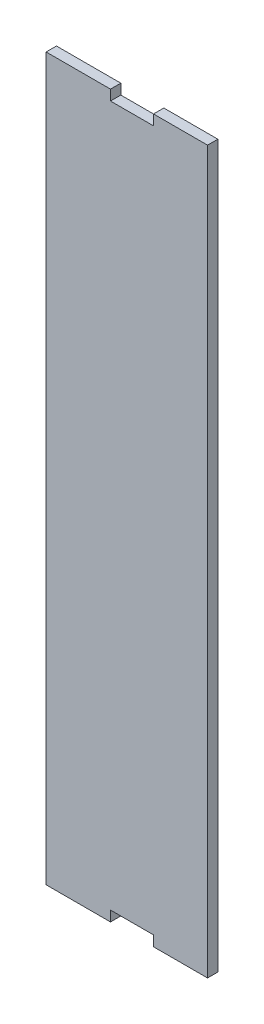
ISO-10303-21;
HEADER;
FILE_DESCRIPTION(('STEP AP214'),'2;1');
FILE_NAME('part.step','',(''),(''),'','','');
FILE_SCHEMA(('AUTOMOTIVE_DESIGN { 1 0 10303 214 1 1 1 1 }'));
ENDSEC;
DATA;
#1=APPLICATION_CONTEXT('core data for automotive mechanical design processes');
#2=APPLICATION_PROTOCOL_DEFINITION('international standard','automotive_design',2000,#1);
#3=PRODUCT_CONTEXT('',#1,'mechanical');
#4=PRODUCT('Part','Part','',(#3));
#5=PRODUCT_RELATED_PRODUCT_CATEGORY('part','',(#4));
#6=PRODUCT_DEFINITION_FORMATION('','',#4);
#7=PRODUCT_DEFINITION_CONTEXT('part definition',#1,'design');
#8=PRODUCT_DEFINITION('design','',#6,#7);
#9=PRODUCT_DEFINITION_SHAPE('','',#8);
#10=(LENGTH_UNIT() NAMED_UNIT(*) SI_UNIT(.MILLI.,.METRE.));
#11=(NAMED_UNIT(*) PLANE_ANGLE_UNIT() SI_UNIT($,.RADIAN.));
#12=(NAMED_UNIT(*) SI_UNIT($,.STERADIAN.) SOLID_ANGLE_UNIT());
#13=UNCERTAINTY_MEASURE_WITH_UNIT(LENGTH_MEASURE(1.E-05),#10,'distance_accuracy_value','');
#14=(GEOMETRIC_REPRESENTATION_CONTEXT(3) GLOBAL_UNCERTAINTY_ASSIGNED_CONTEXT((#13)) GLOBAL_UNIT_ASSIGNED_CONTEXT((#10,
#11,#12)) REPRESENTATION_CONTEXT('',''));
#15=CARTESIAN_POINT('',(0.,0.,0.));
#16=DIRECTION('',(0.,0.,1.));
#17=DIRECTION('',(1.,0.,0.));
#18=AXIS2_PLACEMENT_3D('',#15,#16,#17);
#19=CARTESIAN_POINT('',(9.31557416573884,-1.524,1.524));
#20=DIRECTION('',(-1.,0.,0.));
#21=DIRECTION('',(0.,0.,1.));
#22=AXIS2_PLACEMENT_3D('',#19,#20,#21);
#23=PLANE('',#22);
#24=DIRECTION('',(0.,1.,0.));
#25=VECTOR('',#24,1.);
#26=CARTESIAN_POINT('',(9.31557416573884,-1.524,0.));
#27=LINE('',#26,#25);
#28=CARTESIAN_POINT('',(9.31557416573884,-1.524,0.));
#29=VERTEX_POINT('',#28);
#30=CARTESIAN_POINT('',(9.31557416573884,104.993300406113,0.));
#31=VERTEX_POINT('',#30);
#32=EDGE_CURVE('E156',#29,#31,#27,.T.);
#33=ORIENTED_EDGE('',*,*,#32,.T.);
#34=DIRECTION('',(0.,0.,-1.));
#35=VECTOR('',#34,1.);
#36=CARTESIAN_POINT('',(9.31557416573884,104.993300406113,1.524));
#37=LINE('',#36,#35);
#38=CARTESIAN_POINT('',(9.31557416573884,104.993300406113,1.524));
#39=VERTEX_POINT('',#38);
#40=EDGE_CURVE('E11',#39,#31,#37,.T.);
#41=ORIENTED_EDGE('',*,*,#40,.F.);
#42=DIRECTION('',(0.,1.,0.));
#43=VECTOR('',#42,1.);
#44=CARTESIAN_POINT('',(9.31557416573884,-1.524,1.524));
#45=LINE('',#44,#43);
#46=CARTESIAN_POINT('',(9.31557416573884,-1.524,1.524));
#47=VERTEX_POINT('',#46);
#48=EDGE_CURVE('E178',#47,#39,#45,.T.);
#49=ORIENTED_EDGE('',*,*,#48,.F.);
#50=DIRECTION('',(0.,0.,-1.));
#51=VECTOR('',#50,1.);
#52=CARTESIAN_POINT('',(9.31557416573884,-1.524,1.524));
#53=LINE('',#52,#51);
#54=EDGE_CURVE('E152',#47,#29,#53,.T.);
#55=ORIENTED_EDGE('',*,*,#54,.T.);
#56=EDGE_LOOP('',(#33,#41,#49,#55));
#57=FACE_BOUND('',#56,.T.);
#58=ADVANCED_FACE('F36',(#57),#23,.F.);
#59=CARTESIAN_POINT('',(9.31557416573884,104.993300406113,1.524));
#60=DIRECTION('',(0.,-1.,0.));
#61=DIRECTION('',(0.,0.,-1.));
#62=AXIS2_PLACEMENT_3D('',#59,#60,#61);
#63=PLANE('',#62);
#64=DIRECTION('',(-1.,0.,0.));
#65=VECTOR('',#64,1.);
#66=CARTESIAN_POINT('',(9.31557416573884,104.993300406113,0.));
#67=LINE('',#66,#65);
#68=CARTESIAN_POINT('',(1.33558182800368,104.993300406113,0.));
#69=VERTEX_POINT('',#68);
#70=EDGE_CURVE('E159',#31,#69,#67,.T.);
#71=ORIENTED_EDGE('',*,*,#70,.T.);
#72=DIRECTION('',(0.,0.,-1.));
#73=VECTOR('',#72,1.);
#74=CARTESIAN_POINT('',(1.33558182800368,104.993300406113,1.524));
#75=LINE('',#74,#73);
#76=CARTESIAN_POINT('',(1.33558182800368,104.993300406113,1.524));
#77=VERTEX_POINT('',#76);
#78=EDGE_CURVE('E44',#77,#69,#75,.T.);
#79=ORIENTED_EDGE('',*,*,#78,.F.);
#80=DIRECTION('',(-1.,0.,0.));
#81=VECTOR('',#80,1.);
#82=CARTESIAN_POINT('',(9.31557416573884,104.993300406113,1.524));
#83=LINE('',#82,#81);
#84=EDGE_CURVE('E107',#39,#77,#83,.T.);
#85=ORIENTED_EDGE('',*,*,#84,.F.);
#86=ORIENTED_EDGE('',*,*,#40,.T.);
#87=EDGE_LOOP('',(#71,#79,#85,#86));
#88=FACE_BOUND('',#87,.T.);
#89=ADVANCED_FACE('F256',(#88),#63,.F.);
#90=CARTESIAN_POINT('',(1.33558182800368,103.469300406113,1.524));
#91=DIRECTION('',(1.,0.,0.));
#92=DIRECTION('',(0.,0.,-1.));
#93=AXIS2_PLACEMENT_3D('',#90,#91,#92);
#94=PLANE('',#93);
#95=DIRECTION('',(0.,-1.,0.));
#96=VECTOR('',#95,1.);
#97=CARTESIAN_POINT('',(1.33558182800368,103.469300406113,0.));
#98=LINE('',#97,#96);
#99=CARTESIAN_POINT('',(1.33558182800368,103.469300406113,0.));
#100=VERTEX_POINT('',#99);
#101=EDGE_CURVE('E161',#69,#100,#98,.T.);
#102=ORIENTED_EDGE('',*,*,#101,.T.);
#103=DIRECTION('',(0.,0.,-1.));
#104=VECTOR('',#103,1.);
#105=CARTESIAN_POINT('',(1.33558182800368,103.469300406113,1.524));
#106=LINE('',#105,#104);
#107=CARTESIAN_POINT('',(1.33558182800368,103.469300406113,1.524));
#108=VERTEX_POINT('',#107);
#109=EDGE_CURVE('E197',#108,#100,#106,.T.);
#110=ORIENTED_EDGE('',*,*,#109,.F.);
#111=DIRECTION('',(0.,-1.,0.));
#112=VECTOR('',#111,1.);
#113=CARTESIAN_POINT('',(1.33558182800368,103.469300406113,1.524));
#114=LINE('',#113,#112);
#115=EDGE_CURVE('E205',#77,#108,#114,.T.);
#116=ORIENTED_EDGE('',*,*,#115,.F.);
#117=ORIENTED_EDGE('',*,*,#78,.T.);
#118=EDGE_LOOP('',(#102,#110,#116,#117));
#119=FACE_BOUND('',#118,.T.);
#120=ADVANCED_FACE('F203',(#119),#94,.F.);
#121=CARTESIAN_POINT('',(-5.01441817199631,103.469300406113,1.524));
#122=DIRECTION('',(0.,-1.,0.));
#123=DIRECTION('',(0.,0.,-1.));
#124=AXIS2_PLACEMENT_3D('',#121,#122,#123);
#125=PLANE('',#124);
#126=DIRECTION('',(-1.,0.,0.));
#127=VECTOR('',#126,1.);
#128=CARTESIAN_POINT('',(-5.01441817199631,103.469300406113,0.));
#129=LINE('',#128,#127);
#130=CARTESIAN_POINT('',(-5.01441817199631,103.469300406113,0.));
#131=VERTEX_POINT('',#130);
#132=EDGE_CURVE('E163',#100,#131,#129,.T.);
#133=ORIENTED_EDGE('',*,*,#132,.T.);
#134=DIRECTION('',(0.,0.,-1.));
#135=VECTOR('',#134,1.);
#136=CARTESIAN_POINT('',(-5.01441817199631,103.469300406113,1.524));
#137=LINE('',#136,#135);
#138=CARTESIAN_POINT('',(-5.01441817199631,103.469300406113,1.524));
#139=VERTEX_POINT('',#138);
#140=EDGE_CURVE('E194',#139,#131,#137,.T.);
#141=ORIENTED_EDGE('',*,*,#140,.F.);
#142=DIRECTION('',(-1.,0.,0.));
#143=VECTOR('',#142,1.);
#144=CARTESIAN_POINT('',(-5.01441817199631,103.469300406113,1.524));
#145=LINE('',#144,#143);
#146=EDGE_CURVE('E223',#108,#139,#145,.T.);
#147=ORIENTED_EDGE('',*,*,#146,.F.);
#148=ORIENTED_EDGE('',*,*,#109,.T.);
#149=EDGE_LOOP('',(#133,#141,#147,#148));
#150=FACE_BOUND('',#149,.T.);
#151=ADVANCED_FACE('F214',(#150),#125,.F.);
#152=CARTESIAN_POINT('',(-5.01441817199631,104.993300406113,1.524));
#153=DIRECTION('',(-1.,0.,0.));
#154=DIRECTION('',(0.,0.,1.));
#155=AXIS2_PLACEMENT_3D('',#152,#153,#154);
#156=PLANE('',#155);
#157=DIRECTION('',(0.,1.,0.));
#158=VECTOR('',#157,1.);
#159=CARTESIAN_POINT('',(-5.01441817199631,104.993300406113,0.));
#160=LINE('',#159,#158);
#161=CARTESIAN_POINT('',(-5.01441817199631,104.993300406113,0.));
#162=VERTEX_POINT('',#161);
#163=EDGE_CURVE('E165',#131,#162,#160,.T.);
#164=ORIENTED_EDGE('',*,*,#163,.T.);
#165=DIRECTION('',(0.,0.,-1.));
#166=VECTOR('',#165,1.);
#167=CARTESIAN_POINT('',(-5.01441817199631,104.993300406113,1.524));
#168=LINE('',#167,#166);
#169=CARTESIAN_POINT('',(-5.01441817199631,104.993300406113,1.524));
#170=VERTEX_POINT('',#169);
#171=EDGE_CURVE('E191',#170,#162,#168,.T.);
#172=ORIENTED_EDGE('',*,*,#171,.F.);
#173=DIRECTION('',(0.,1.,0.));
#174=VECTOR('',#173,1.);
#175=CARTESIAN_POINT('',(-5.01441817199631,104.993300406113,1.524));
#176=LINE('',#175,#174);
#177=EDGE_CURVE('E220',#139,#170,#176,.T.);
#178=ORIENTED_EDGE('',*,*,#177,.F.);
#179=ORIENTED_EDGE('',*,*,#140,.T.);
#180=EDGE_LOOP('',(#164,#172,#178,#179));
#181=FACE_BOUND('',#180,.T.);
#182=ADVANCED_FACE('F218',(#181),#156,.F.);
#183=CARTESIAN_POINT('',(-5.01441817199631,104.993300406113,1.524));
#184=DIRECTION('',(0.,-1.,0.));
#185=DIRECTION('',(0.,0.,-1.));
#186=AXIS2_PLACEMENT_3D('',#183,#184,#185);
#187=PLANE('',#186);
#188=DIRECTION('',(-1.,0.,0.));
#189=VECTOR('',#188,1.);
#190=CARTESIAN_POINT('',(-5.01441817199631,104.993300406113,0.));
#191=LINE('',#190,#189);
#192=CARTESIAN_POINT('',(-14.5184105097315,104.993300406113,0.));
#193=VERTEX_POINT('',#192);
#194=EDGE_CURVE('E167',#162,#193,#191,.T.);
#195=ORIENTED_EDGE('',*,*,#194,.T.);
#196=DIRECTION('',(0.,0.,-1.));
#197=VECTOR('',#196,1.);
#198=CARTESIAN_POINT('',(-14.5184105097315,104.993300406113,1.524));
#199=LINE('',#198,#197);
#200=CARTESIAN_POINT('',(-14.5184105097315,104.993300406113,1.524));
#201=VERTEX_POINT('',#200);
#202=EDGE_CURVE('E188',#201,#193,#199,.T.);
#203=ORIENTED_EDGE('',*,*,#202,.F.);
#204=DIRECTION('',(-1.,0.,0.));
#205=VECTOR('',#204,1.);
#206=CARTESIAN_POINT('',(-5.01441817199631,104.993300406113,1.524));
#207=LINE('',#206,#205);
#208=EDGE_CURVE('E222',#170,#201,#207,.T.);
#209=ORIENTED_EDGE('',*,*,#208,.F.);
#210=ORIENTED_EDGE('',*,*,#171,.T.);
#211=EDGE_LOOP('',(#195,#203,#209,#210));
#212=FACE_BOUND('',#211,.T.);
#213=ADVANCED_FACE('F269',(#212),#187,.F.);
#214=CARTESIAN_POINT('',(-14.5184105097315,-1.524,1.524));
#215=DIRECTION('',(1.,0.,0.));
#216=DIRECTION('',(0.,0.,-1.));
#217=AXIS2_PLACEMENT_3D('',#214,#215,#216);
#218=PLANE('',#217);
#219=DIRECTION('',(0.,-1.,0.));
#220=VECTOR('',#219,1.);
#221=CARTESIAN_POINT('',(-14.5184105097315,-1.524,0.));
#222=LINE('',#221,#220);
#223=CARTESIAN_POINT('',(-14.5184105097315,-1.524,0.));
#224=VERTEX_POINT('',#223);
#225=EDGE_CURVE('E169',#193,#224,#222,.T.);
#226=ORIENTED_EDGE('',*,*,#225,.T.);
#227=DIRECTION('',(0.,0.,-1.));
#228=VECTOR('',#227,1.);
#229=CARTESIAN_POINT('',(-14.5184105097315,-1.524,1.524));
#230=LINE('',#229,#228);
#231=CARTESIAN_POINT('',(-14.5184105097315,-1.524,1.524));
#232=VERTEX_POINT('',#231);
#233=EDGE_CURVE('E185',#232,#224,#230,.T.);
#234=ORIENTED_EDGE('',*,*,#233,.F.);
#235=DIRECTION('',(0.,-1.,0.));
#236=VECTOR('',#235,1.);
#237=CARTESIAN_POINT('',(-14.5184105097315,-1.524,1.524));
#238=LINE('',#237,#236);
#239=EDGE_CURVE('E225',#201,#232,#238,.T.);
#240=ORIENTED_EDGE('',*,*,#239,.F.);
#241=ORIENTED_EDGE('',*,*,#202,.T.);
#242=EDGE_LOOP('',(#226,#234,#240,#241));
#243=FACE_BOUND('',#242,.T.);
#244=ADVANCED_FACE('F272',(#243),#218,.F.);
#245=CARTESIAN_POINT('',(-5.01441817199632,-1.524,1.524));
#246=DIRECTION('',(0.,1.,0.));
#247=DIRECTION('',(0.,0.,1.));
#248=AXIS2_PLACEMENT_3D('',#245,#246,#247);
#249=PLANE('',#248);
#250=DIRECTION('',(1.,0.,0.));
#251=VECTOR('',#250,1.);
#252=CARTESIAN_POINT('',(-5.01441817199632,-1.524,0.));
#253=LINE('',#252,#251);
#254=CARTESIAN_POINT('',(-5.01441817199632,-1.524,0.));
#255=VERTEX_POINT('',#254);
#256=EDGE_CURVE('E171',#224,#255,#253,.T.);
#257=ORIENTED_EDGE('',*,*,#256,.T.);
#258=DIRECTION('',(0.,0.,-1.));
#259=VECTOR('',#258,1.);
#260=CARTESIAN_POINT('',(-5.01441817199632,-1.524,1.524));
#261=LINE('',#260,#259);
#262=CARTESIAN_POINT('',(-5.01441817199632,-1.524,1.524));
#263=VERTEX_POINT('',#262);
#264=EDGE_CURVE('E182',#263,#255,#261,.T.);
#265=ORIENTED_EDGE('',*,*,#264,.F.);
#266=DIRECTION('',(1.,0.,0.));
#267=VECTOR('',#266,1.);
#268=CARTESIAN_POINT('',(-5.01441817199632,-1.524,1.524));
#269=LINE('',#268,#267);
#270=EDGE_CURVE('E231',#232,#263,#269,.T.);
#271=ORIENTED_EDGE('',*,*,#270,.F.);
#272=ORIENTED_EDGE('',*,*,#233,.T.);
#273=EDGE_LOOP('',(#257,#265,#271,#272));
#274=FACE_BOUND('',#273,.T.);
#275=ADVANCED_FACE('F237',(#274),#249,.F.);
#276=CARTESIAN_POINT('',(-5.01441817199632,-1.524,1.524));
#277=DIRECTION('',(-1.,0.,0.));
#278=DIRECTION('',(0.,0.,1.));
#279=AXIS2_PLACEMENT_3D('',#276,#277,#278);
#280=PLANE('',#279);
#281=DIRECTION('',(0.,1.,0.));
#282=VECTOR('',#281,1.);
#283=CARTESIAN_POINT('',(-5.01441817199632,-1.524,0.));
#284=LINE('',#283,#282);
#285=CARTESIAN_POINT('',(-5.01441817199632,0.,0.));
#286=VERTEX_POINT('',#285);
#287=EDGE_CURVE('E173',#255,#286,#284,.T.);
#288=ORIENTED_EDGE('',*,*,#287,.T.);
#289=DIRECTION('',(0.,0.,-1.));
#290=VECTOR('',#289,1.);
#291=CARTESIAN_POINT('',(-5.01441817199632,0.,1.524));
#292=LINE('',#291,#290);
#293=CARTESIAN_POINT('',(-5.01441817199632,0.,1.524));
#294=VERTEX_POINT('',#293);
#295=EDGE_CURVE('E147',#294,#286,#292,.T.);
#296=ORIENTED_EDGE('',*,*,#295,.F.);
#297=DIRECTION('',(0.,1.,0.));
#298=VECTOR('',#297,1.);
#299=CARTESIAN_POINT('',(-5.01441817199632,-1.524,1.524));
#300=LINE('',#299,#298);
#301=EDGE_CURVE('E138',#263,#294,#300,.T.);
#302=ORIENTED_EDGE('',*,*,#301,.F.);
#303=ORIENTED_EDGE('',*,*,#264,.T.);
#304=EDGE_LOOP('',(#288,#296,#302,#303));
#305=FACE_BOUND('',#304,.T.);
#306=ADVANCED_FACE('F241',(#305),#280,.F.);
#307=CARTESIAN_POINT('',(-5.01441817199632,0.,1.524));
#308=DIRECTION('',(0.,1.,0.));
#309=DIRECTION('',(0.,0.,1.));
#310=AXIS2_PLACEMENT_3D('',#307,#308,#309);
#311=PLANE('',#310);
#312=DIRECTION('',(1.,0.,0.));
#313=VECTOR('',#312,1.);
#314=CARTESIAN_POINT('',(-5.01441817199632,0.,0.));
#315=LINE('',#314,#313);
#316=CARTESIAN_POINT('',(1.33558182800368,0.,0.));
#317=VERTEX_POINT('',#316);
#318=EDGE_CURVE('E146',#286,#317,#315,.T.);
#319=ORIENTED_EDGE('',*,*,#318,.T.);
#320=DIRECTION('',(0.,0.,-1.));
#321=VECTOR('',#320,1.);
#322=CARTESIAN_POINT('',(1.33558182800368,0.,1.524));
#323=LINE('',#322,#321);
#324=CARTESIAN_POINT('',(1.33558182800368,0.,1.524));
#325=VERTEX_POINT('',#324);
#326=EDGE_CURVE('E143',#325,#317,#323,.T.);
#327=ORIENTED_EDGE('',*,*,#326,.F.);
#328=DIRECTION('',(1.,0.,0.));
#329=VECTOR('',#328,1.);
#330=CARTESIAN_POINT('',(-5.01441817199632,0.,1.524));
#331=LINE('',#330,#329);
#332=EDGE_CURVE('E132',#294,#325,#331,.T.);
#333=ORIENTED_EDGE('',*,*,#332,.F.);
#334=ORIENTED_EDGE('',*,*,#295,.T.);
#335=EDGE_LOOP('',(#319,#327,#333,#334));
#336=FACE_BOUND('',#335,.T.);
#337=ADVANCED_FACE('F144',(#336),#311,.F.);
#338=CARTESIAN_POINT('',(1.33558182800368,0.,1.524));
#339=DIRECTION('',(1.,0.,0.));
#340=DIRECTION('',(0.,0.,-1.));
#341=AXIS2_PLACEMENT_3D('',#338,#339,#340);
#342=PLANE('',#341);
#343=DIRECTION('',(0.,-1.,0.));
#344=VECTOR('',#343,1.);
#345=CARTESIAN_POINT('',(1.33558182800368,0.,0.));
#346=LINE('',#345,#344);
#347=CARTESIAN_POINT('',(1.33558182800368,-1.524,0.));
#348=VERTEX_POINT('',#347);
#349=EDGE_CURVE('E93',#317,#348,#346,.T.);
#350=ORIENTED_EDGE('',*,*,#349,.T.);
#351=DIRECTION('',(0.,0.,-1.));
#352=VECTOR('',#351,1.);
#353=CARTESIAN_POINT('',(1.33558182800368,-1.524,1.524));
#354=LINE('',#353,#352);
#355=CARTESIAN_POINT('',(1.33558182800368,-1.524,1.524));
#356=VERTEX_POINT('',#355);
#357=EDGE_CURVE('E148',#356,#348,#354,.T.);
#358=ORIENTED_EDGE('',*,*,#357,.F.);
#359=DIRECTION('',(0.,-1.,0.));
#360=VECTOR('',#359,1.);
#361=CARTESIAN_POINT('',(1.33558182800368,0.,1.524));
#362=LINE('',#361,#360);
#363=EDGE_CURVE('E136',#325,#356,#362,.T.);
#364=ORIENTED_EDGE('',*,*,#363,.F.);
#365=ORIENTED_EDGE('',*,*,#326,.T.);
#366=EDGE_LOOP('',(#350,#358,#364,#365));
#367=FACE_BOUND('',#366,.T.);
#368=ADVANCED_FACE('F150',(#367),#342,.F.);
#369=CARTESIAN_POINT('',(9.31557416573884,-1.524,1.524));
#370=DIRECTION('',(0.,1.,0.));
#371=DIRECTION('',(0.,0.,1.));
#372=AXIS2_PLACEMENT_3D('',#369,#370,#371);
#373=PLANE('',#372);
#374=DIRECTION('',(1.,0.,0.));
#375=VECTOR('',#374,1.);
#376=CARTESIAN_POINT('',(9.31557416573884,-1.524,0.));
#377=LINE('',#376,#375);
#378=EDGE_CURVE('E99',#348,#29,#377,.T.);
#379=ORIENTED_EDGE('',*,*,#378,.T.);
#380=ORIENTED_EDGE('',*,*,#54,.F.);
#381=DIRECTION('',(1.,0.,0.));
#382=VECTOR('',#381,1.);
#383=CARTESIAN_POINT('',(9.31557416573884,-1.524,1.524));
#384=LINE('',#383,#382);
#385=EDGE_CURVE('E52',#356,#47,#384,.T.);
#386=ORIENTED_EDGE('',*,*,#385,.F.);
#387=ORIENTED_EDGE('',*,*,#357,.T.);
#388=EDGE_LOOP('',(#379,#380,#386,#387));
#389=FACE_BOUND('',#388,.T.);
#390=ADVANCED_FACE('F245',(#389),#373,.F.);
#391=CARTESIAN_POINT('',(0.,0.,1.524));
#392=DIRECTION('',(0.,0.,1.));
#393=DIRECTION('',(1.,0.,0.));
#394=AXIS2_PLACEMENT_3D('',#391,#392,#393);
#395=PLANE('',#394);
#396=ORIENTED_EDGE('',*,*,#48,.T.);
#397=ORIENTED_EDGE('',*,*,#84,.T.);
#398=ORIENTED_EDGE('',*,*,#115,.T.);
#399=ORIENTED_EDGE('',*,*,#146,.T.);
#400=ORIENTED_EDGE('',*,*,#177,.T.);
#401=ORIENTED_EDGE('',*,*,#208,.T.);
#402=ORIENTED_EDGE('',*,*,#239,.T.);
#403=ORIENTED_EDGE('',*,*,#270,.T.);
#404=ORIENTED_EDGE('',*,*,#301,.T.);
#405=ORIENTED_EDGE('',*,*,#332,.T.);
#406=ORIENTED_EDGE('',*,*,#363,.T.);
#407=ORIENTED_EDGE('',*,*,#385,.T.);
#408=EDGE_LOOP('',(#396,#397,#398,#399,#400,#401,#402,#403,#404,#405,#406,#407));
#409=FACE_BOUND('',#408,.T.);
#410=ADVANCED_FACE('F134',(#409),#395,.T.);
#411=CARTESIAN_POINT('',(0.,0.,0.));
#412=DIRECTION('',(0.,0.,1.));
#413=DIRECTION('',(1.,0.,0.));
#414=AXIS2_PLACEMENT_3D('',#411,#412,#413);
#415=PLANE('',#414);
#416=ORIENTED_EDGE('',*,*,#32,.F.);
#417=ORIENTED_EDGE('',*,*,#378,.F.);
#418=ORIENTED_EDGE('',*,*,#349,.F.);
#419=ORIENTED_EDGE('',*,*,#318,.F.);
#420=ORIENTED_EDGE('',*,*,#287,.F.);
#421=ORIENTED_EDGE('',*,*,#256,.F.);
#422=ORIENTED_EDGE('',*,*,#225,.F.);
#423=ORIENTED_EDGE('',*,*,#194,.F.);
#424=ORIENTED_EDGE('',*,*,#163,.F.);
#425=ORIENTED_EDGE('',*,*,#132,.F.);
#426=ORIENTED_EDGE('',*,*,#101,.F.);
#427=ORIENTED_EDGE('',*,*,#70,.F.);
#428=EDGE_LOOP('',(#416,#417,#418,#419,#420,#421,#422,#423,#424,#425,#426,#427));
#429=FACE_BOUND('',#428,.T.);
#430=ADVANCED_FACE('F209',(#429),#415,.F.);
#431=CLOSED_SHELL('',(#58,#89,#120,#151,#182,#213,#244,#275,#306,#337,#368,#390,#410,#430));
#432=MANIFOLD_SOLID_BREP('B2',#431);
#433=ADVANCED_BREP_SHAPE_REPRESENTATION('',(#18,#432),#14);
#434=SHAPE_DEFINITION_REPRESENTATION(#9,#433);
ENDSEC;
END-ISO-10303-21;
